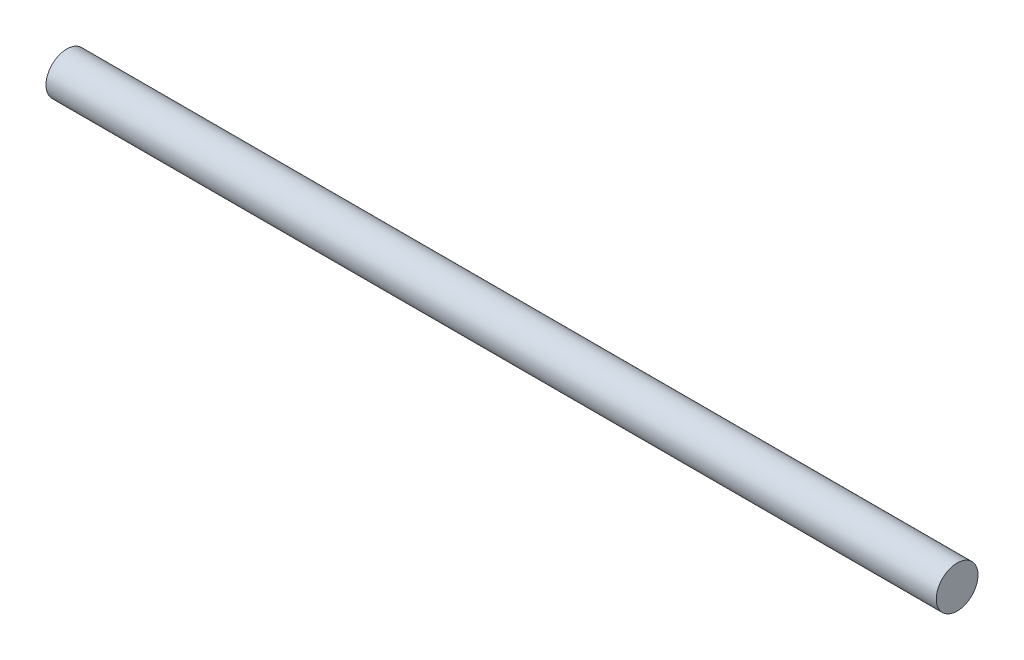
ISO-10303-21;
HEADER;
FILE_DESCRIPTION(('STEP AP214'),'2;1');
FILE_NAME('part.step','',(''),(''),'','','');
FILE_SCHEMA(('AUTOMOTIVE_DESIGN { 1 0 10303 214 1 1 1 1 }'));
ENDSEC;
DATA;
#1=APPLICATION_CONTEXT('core data for automotive mechanical design processes');
#2=APPLICATION_PROTOCOL_DEFINITION('international standard','automotive_design',2000,#1);
#3=PRODUCT_CONTEXT('',#1,'mechanical');
#4=PRODUCT('Part','Part','',(#3));
#5=PRODUCT_RELATED_PRODUCT_CATEGORY('part','',(#4));
#6=PRODUCT_DEFINITION_FORMATION('','',#4);
#7=PRODUCT_DEFINITION_CONTEXT('part definition',#1,'design');
#8=PRODUCT_DEFINITION('design','',#6,#7);
#9=PRODUCT_DEFINITION_SHAPE('','',#8);
#10=(LENGTH_UNIT() NAMED_UNIT(*) SI_UNIT(.MILLI.,.METRE.));
#11=(NAMED_UNIT(*) PLANE_ANGLE_UNIT() SI_UNIT($,.RADIAN.));
#12=(NAMED_UNIT(*) SI_UNIT($,.STERADIAN.) SOLID_ANGLE_UNIT());
#13=UNCERTAINTY_MEASURE_WITH_UNIT(LENGTH_MEASURE(1.E-05),#10,'distance_accuracy_value','');
#14=(GEOMETRIC_REPRESENTATION_CONTEXT(3) GLOBAL_UNCERTAINTY_ASSIGNED_CONTEXT((#13)) GLOBAL_UNIT_ASSIGNED_CONTEXT((#10,
#11,#12)) REPRESENTATION_CONTEXT('',''));
#15=CARTESIAN_POINT('',(0.,0.,0.));
#16=DIRECTION('',(0.,0.,1.));
#17=DIRECTION('',(1.,0.,0.));
#18=AXIS2_PLACEMENT_3D('',#15,#16,#17);
#19=CARTESIAN_POINT('',(203.2,0.,0.));
#20=DIRECTION('',(-1.,0.,0.));
#21=DIRECTION('',(0.,0.,1.));
#22=AXIS2_PLACEMENT_3D('',#19,#20,#21);
#23=CYLINDRICAL_SURFACE('',#22,4.7625);
#24=CARTESIAN_POINT('',(203.2,0.,0.));
#25=DIRECTION('',(1.,0.,0.));
#26=DIRECTION('',(0.,0.,-1.));
#27=AXIS2_PLACEMENT_3D('',#24,#25,#26);
#28=CIRCLE('',#27,4.7625);
#29=CARTESIAN_POINT('',(203.2,0.,-4.7625));
#30=VERTEX_POINT('',#29);
#31=EDGE_CURVE('E10',#30,#30,#28,.T.);
#32=ORIENTED_EDGE('',*,*,#31,.F.);
#33=EDGE_LOOP('',(#32));
#34=FACE_BOUND('',#33,.T.);
#35=CARTESIAN_POINT('',(0.,0.,0.));
#36=DIRECTION('',(1.,0.,0.));
#37=DIRECTION('',(0.,0.,-1.));
#38=AXIS2_PLACEMENT_3D('',#35,#36,#37);
#39=CIRCLE('',#38,4.7625);
#40=CARTESIAN_POINT('',(0.,0.,-4.7625));
#41=VERTEX_POINT('',#40);
#42=EDGE_CURVE('E35',#41,#41,#39,.T.);
#43=ORIENTED_EDGE('',*,*,#42,.T.);
#44=EDGE_LOOP('',(#43));
#45=FACE_BOUND('',#44,.T.);
#46=ADVANCED_FACE('F29',(#34,#45),#23,.T.);
#47=CARTESIAN_POINT('',(203.2,0.,0.));
#48=DIRECTION('',(1.,0.,0.));
#49=DIRECTION('',(0.,0.,-1.));
#50=AXIS2_PLACEMENT_3D('',#47,#48,#49);
#51=PLANE('',#50);
#52=ORIENTED_EDGE('',*,*,#31,.T.);
#53=EDGE_LOOP('',(#52));
#54=FACE_BOUND('',#53,.T.);
#55=ADVANCED_FACE('F44',(#54),#51,.T.);
#56=CARTESIAN_POINT('',(0.,0.,0.));
#57=DIRECTION('',(1.,0.,0.));
#58=DIRECTION('',(0.,0.,-1.));
#59=AXIS2_PLACEMENT_3D('',#56,#57,#58);
#60=PLANE('',#59);
#61=ORIENTED_EDGE('',*,*,#42,.F.);
#62=EDGE_LOOP('',(#61));
#63=FACE_BOUND('',#62,.T.);
#64=ADVANCED_FACE('F42',(#63),#60,.F.);
#65=CLOSED_SHELL('',(#46,#55,#64));
#66=MANIFOLD_SOLID_BREP('B2',#65);
#67=ADVANCED_BREP_SHAPE_REPRESENTATION('',(#18,#66),#14);
#68=SHAPE_DEFINITION_REPRESENTATION(#9,#67);
ENDSEC;
END-ISO-10303-21;
